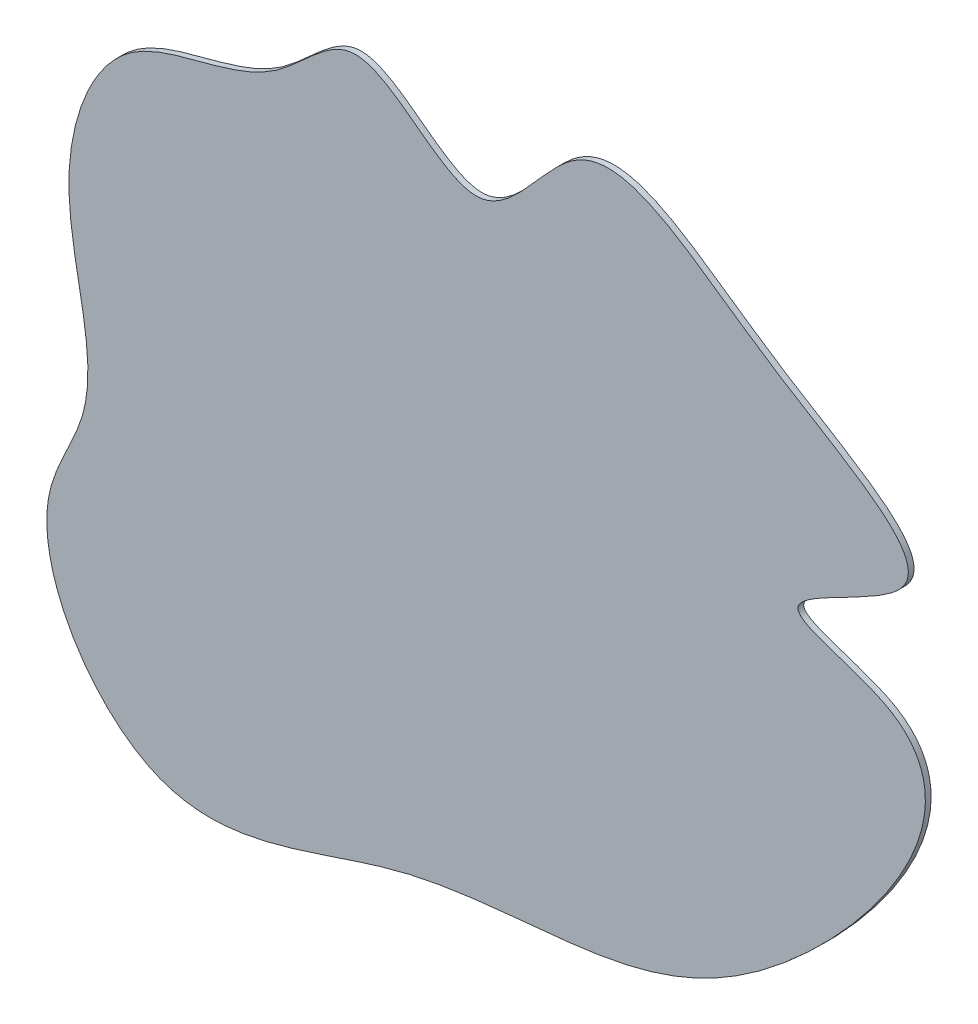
ISO-10303-21;
HEADER;
FILE_DESCRIPTION(('STEP AP214'),'2;1');
FILE_NAME('part.step','',(''),(''),'','','');
FILE_SCHEMA(('AUTOMOTIVE_DESIGN { 1 0 10303 214 1 1 1 1 }'));
ENDSEC;
DATA;
#1=APPLICATION_CONTEXT('core data for automotive mechanical design processes');
#2=APPLICATION_PROTOCOL_DEFINITION('international standard','automotive_design',2000,#1);
#3=PRODUCT_CONTEXT('',#1,'mechanical');
#4=PRODUCT('Part','Part','',(#3));
#5=PRODUCT_RELATED_PRODUCT_CATEGORY('part','',(#4));
#6=PRODUCT_DEFINITION_FORMATION('','',#4);
#7=PRODUCT_DEFINITION_CONTEXT('part definition',#1,'design');
#8=PRODUCT_DEFINITION('design','',#6,#7);
#9=PRODUCT_DEFINITION_SHAPE('','',#8);
#10=(LENGTH_UNIT() NAMED_UNIT(*) SI_UNIT(.MILLI.,.METRE.));
#11=(NAMED_UNIT(*) PLANE_ANGLE_UNIT() SI_UNIT($,.RADIAN.));
#12=(NAMED_UNIT(*) SI_UNIT($,.STERADIAN.) SOLID_ANGLE_UNIT());
#13=UNCERTAINTY_MEASURE_WITH_UNIT(LENGTH_MEASURE(1.E-05),#10,'distance_accuracy_value','');
#14=(GEOMETRIC_REPRESENTATION_CONTEXT(3) GLOBAL_UNCERTAINTY_ASSIGNED_CONTEXT((#13)) GLOBAL_UNIT_ASSIGNED_CONTEXT((#10,
#11,#12)) REPRESENTATION_CONTEXT('',''));
#15=CARTESIAN_POINT('',(0.,0.,0.));
#16=DIRECTION('',(0.,0.,1.));
#17=DIRECTION('',(1.,0.,0.));
#18=AXIS2_PLACEMENT_3D('',#15,#16,#17);
#19=CARTESIAN_POINT('',(-21.661404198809,34.0548721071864,1.));
#20=CARTESIAN_POINT('',(-29.6888162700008,28.4127176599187,1.));
#21=CARTESIAN_POINT('',(-49.8354681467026,29.489049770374,1.));
#22=CARTESIAN_POINT('',(-62.3919091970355,-3.58124951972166,1.));
#23=CARTESIAN_POINT('',(-49.5735044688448,-29.2286166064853,1.));
#24=CARTESIAN_POINT('',(-67.8035841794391,-55.1856114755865,1.));
#25=CARTESIAN_POINT('',(-42.8025483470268,-95.1435111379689,1.));
#26=CARTESIAN_POINT('',(-1.73049935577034,-71.943136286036,1.));
#27=CARTESIAN_POINT('',(37.3850016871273,-72.9632064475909,1.));
#28=CARTESIAN_POINT('',(70.622595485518,-58.0374504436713,1.));
#29=CARTESIAN_POINT('',(106.897469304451,-9.73226209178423,1.));
#30=CARTESIAN_POINT('',(56.9158477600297,-2.27669756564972,1.));
#31=CARTESIAN_POINT('',(103.098267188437,12.0429795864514,1.));
#32=CARTESIAN_POINT('',(58.3802788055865,33.1563241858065,1.));
#33=CARTESIAN_POINT('',(33.033698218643,58.8656782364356,1.));
#34=CARTESIAN_POINT('',(13.5078177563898,22.1420565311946,1.));
#35=CARTESIAN_POINT('',(-6.86923701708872,51.33812409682,1.));
#36=CARTESIAN_POINT('',(-16.8522418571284,37.4350445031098,1.));
#37=CARTESIAN_POINT('',(-21.661404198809,34.0548721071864,1.));
#38=B_SPLINE_CURVE_WITH_KNOTS('',3,(#19,#20,#21,#22,#23,#24,#25,#26,#27,#28,#29,#30,#31,#32,#33,
#34,#35,#36,#37),.UNSPECIFIED.,.T.,.F.,(4,1,1,1,1,1,1,1,1,1,1,1,1,1,1,1,4),(0.,
0.0571825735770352,0.112713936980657,0.185714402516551,0.219037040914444,0.298383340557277,
0.389371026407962,0.469137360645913,0.539977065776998,0.643888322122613,0.680328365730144,
0.725797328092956,0.790807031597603,0.870930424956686,0.91496687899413,0.965742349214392,1.),.UNSPECIFIED.);
#39=DIRECTION('',(0.,0.,-1.));
#40=VECTOR('',#39,1.);
#41=SURFACE_OF_LINEAR_EXTRUSION('',#38,#40);
#42=CARTESIAN_POINT('',(-21.661404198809,34.0548721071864,1.));
#43=VERTEX_POINT('',#42);
#44=EDGE_CURVE('E10',#43,#43,#38,.T.);
#45=ORIENTED_EDGE('',*,*,#44,.F.);
#46=EDGE_LOOP('',(#45));
#47=FACE_BOUND('',#46,.T.);
#48=CARTESIAN_POINT('',(-21.661404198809,34.0548721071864,0.));
#49=CARTESIAN_POINT('',(-29.6888162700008,28.4127176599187,0.));
#50=CARTESIAN_POINT('',(-49.8354681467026,29.489049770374,0.));
#51=CARTESIAN_POINT('',(-62.3919091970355,-3.58124951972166,0.));
#52=CARTESIAN_POINT('',(-49.5735044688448,-29.2286166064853,0.));
#53=CARTESIAN_POINT('',(-67.8035841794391,-55.1856114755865,0.));
#54=CARTESIAN_POINT('',(-42.8025483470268,-95.1435111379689,0.));
#55=CARTESIAN_POINT('',(-1.73049935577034,-71.943136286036,0.));
#56=CARTESIAN_POINT('',(37.3850016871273,-72.9632064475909,0.));
#57=CARTESIAN_POINT('',(70.622595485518,-58.0374504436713,0.));
#58=CARTESIAN_POINT('',(106.897469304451,-9.73226209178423,0.));
#59=CARTESIAN_POINT('',(56.9158477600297,-2.27669756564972,0.));
#60=CARTESIAN_POINT('',(103.098267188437,12.0429795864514,0.));
#61=CARTESIAN_POINT('',(58.3802788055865,33.1563241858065,0.));
#62=CARTESIAN_POINT('',(33.033698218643,58.8656782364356,0.));
#63=CARTESIAN_POINT('',(13.5078177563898,22.1420565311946,0.));
#64=CARTESIAN_POINT('',(-6.86923701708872,51.33812409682,0.));
#65=CARTESIAN_POINT('',(-16.8522418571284,37.4350445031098,0.));
#66=CARTESIAN_POINT('',(-21.661404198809,34.0548721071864,0.));
#67=B_SPLINE_CURVE_WITH_KNOTS('',3,(#48,#49,#50,#51,#52,#53,#54,#55,#56,#57,#58,#59,#60,#61,#62,
#63,#64,#65,#66),.UNSPECIFIED.,.T.,.F.,(4,1,1,1,1,1,1,1,1,1,1,1,1,1,1,1,4),(0.,
0.0571825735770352,0.112713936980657,0.185714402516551,0.219037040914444,0.298383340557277,
0.389371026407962,0.469137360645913,0.539977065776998,0.643888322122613,0.680328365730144,
0.725797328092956,0.790807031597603,0.870930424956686,0.91496687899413,0.965742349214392,1.),.UNSPECIFIED.);
#68=CARTESIAN_POINT('',(-21.661404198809,34.0548721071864,0.));
#69=VERTEX_POINT('',#68);
#70=EDGE_CURVE('E33',#69,#69,#67,.T.);
#71=ORIENTED_EDGE('',*,*,#70,.T.);
#72=EDGE_LOOP('',(#71));
#73=FACE_BOUND('',#72,.T.);
#74=ADVANCED_FACE('F29',(#47,#73),#41,.F.);
#75=CARTESIAN_POINT('',(50.5520992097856,-66.2296893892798,1.));
#76=DIRECTION('',(0.,0.,1.));
#77=DIRECTION('',(1.,0.,0.));
#78=AXIS2_PLACEMENT_3D('',#75,#76,#77);
#79=PLANE('',#78);
#80=ORIENTED_EDGE('',*,*,#44,.T.);
#81=EDGE_LOOP('',(#80));
#82=FACE_BOUND('',#81,.T.);
#83=ADVANCED_FACE('F52',(#82),#79,.T.);
#84=CARTESIAN_POINT('',(50.5520992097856,-66.2296893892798,0.));
#85=DIRECTION('',(0.,0.,1.));
#86=DIRECTION('',(1.,0.,0.));
#87=AXIS2_PLACEMENT_3D('',#84,#85,#86);
#88=PLANE('',#87);
#89=ORIENTED_EDGE('',*,*,#70,.F.);
#90=EDGE_LOOP('',(#89));
#91=FACE_BOUND('',#90,.T.);
#92=ADVANCED_FACE('F50',(#91),#88,.F.);
#93=CLOSED_SHELL('',(#74,#83,#92));
#94=MANIFOLD_SOLID_BREP('B2',#93);
#95=ADVANCED_BREP_SHAPE_REPRESENTATION('',(#18,#94),#14);
#96=SHAPE_DEFINITION_REPRESENTATION(#9,#95);
ENDSEC;
END-ISO-10303-21;
